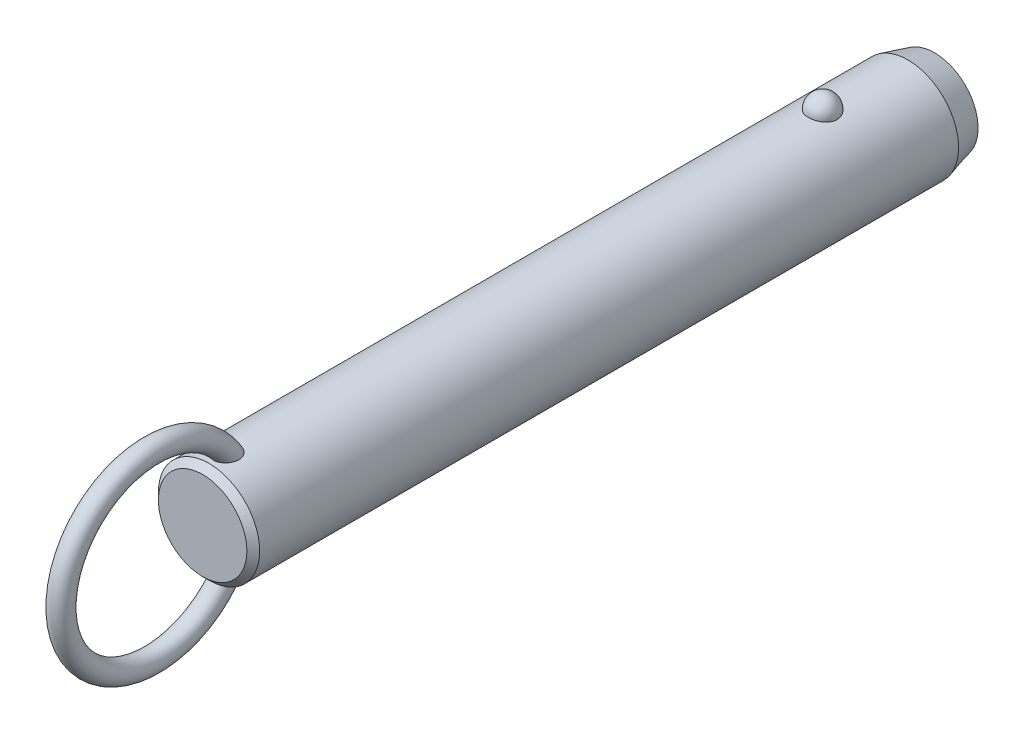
ISO-10303-21;
HEADER;
FILE_DESCRIPTION(('STEP AP214'),'2;1');
FILE_NAME('part.step','',(''),(''),'','','');
FILE_SCHEMA(('AUTOMOTIVE_DESIGN { 1 0 10303 214 1 1 1 1 }'));
ENDSEC;
DATA;
#1=APPLICATION_CONTEXT('core data for automotive mechanical design processes');
#2=APPLICATION_PROTOCOL_DEFINITION('international standard','automotive_design',2000,#1);
#3=PRODUCT_CONTEXT('',#1,'mechanical');
#4=PRODUCT('Part','Part','',(#3));
#5=PRODUCT_RELATED_PRODUCT_CATEGORY('part','',(#4));
#6=PRODUCT_DEFINITION_FORMATION('','',#4);
#7=PRODUCT_DEFINITION_CONTEXT('part definition',#1,'design');
#8=PRODUCT_DEFINITION('design','',#6,#7);
#9=PRODUCT_DEFINITION_SHAPE('','',#8);
#10=(LENGTH_UNIT() NAMED_UNIT(*) SI_UNIT(.MILLI.,.METRE.));
#11=(NAMED_UNIT(*) PLANE_ANGLE_UNIT() SI_UNIT($,.RADIAN.));
#12=(NAMED_UNIT(*) SI_UNIT($,.STERADIAN.) SOLID_ANGLE_UNIT());
#13=UNCERTAINTY_MEASURE_WITH_UNIT(LENGTH_MEASURE(1.E-05),#10,'distance_accuracy_value','');
#14=(GEOMETRIC_REPRESENTATION_CONTEXT(3) GLOBAL_UNCERTAINTY_ASSIGNED_CONTEXT((#13)) GLOBAL_UNIT_ASSIGNED_CONTEXT((#10,
#11,#12)) REPRESENTATION_CONTEXT('',''));
#15=CARTESIAN_POINT('',(0.,0.,0.));
#16=DIRECTION('',(0.,0.,1.));
#17=DIRECTION('',(1.,0.,0.));
#18=AXIS2_PLACEMENT_3D('',#15,#16,#17);
#19=CARTESIAN_POINT('',(0.,0.,104.1));
#20=DIRECTION('',(0.,0.,-1.));
#21=DIRECTION('',(-1.,0.,0.));
#22=AXIS2_PLACEMENT_3D('',#19,#20,#21);
#23=CYLINDRICAL_SURFACE('',#22,9.5);
#24=CARTESIAN_POINT('',(2.67259918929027,9.11631578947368,-2.70000000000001));
#25=CARTESIAN_POINT('',(2.6725968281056,9.11631786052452,-2.54909854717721));
#26=CARTESIAN_POINT('',(2.66030567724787,9.11994722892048,-2.39816735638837));
#27=CARTESIAN_POINT('',(2.6114347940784,9.13405924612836,-2.10058568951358));
#28=CARTESIAN_POINT('',(2.57484658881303,9.14454428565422,-1.95393672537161));
#29=CARTESIAN_POINT('',(2.47830875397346,9.17117631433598,-1.66916069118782));
#30=CARTESIAN_POINT('',(2.41836936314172,9.18732082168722,-1.53102991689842));
#31=CARTESIAN_POINT('',(2.27661331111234,9.22346780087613,-1.26705393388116));
#32=CARTESIAN_POINT('',(2.19479699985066,9.24347021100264,-1.14120852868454));
#33=CARTESIAN_POINT('',(2.01085282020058,9.28522401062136,-0.904632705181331));
#34=CARTESIAN_POINT('',(1.90862396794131,9.30698376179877,-0.793982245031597));
#35=CARTESIAN_POINT('',(1.6867437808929,9.34973971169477,-0.591607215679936));
#36=CARTESIAN_POINT('',(1.56709244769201,9.37073591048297,-0.499882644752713));
#37=CARTESIAN_POINT('',(1.31393976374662,9.40956370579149,-0.338167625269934));
#38=CARTESIAN_POINT('',(1.18048026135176,9.42740444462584,-0.268113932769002));
#39=CARTESIAN_POINT('',(0.903154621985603,9.45799906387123,-0.151390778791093));
#40=CARTESIAN_POINT('',(0.759289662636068,9.47075351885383,-0.104718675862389));
#41=CARTESIAN_POINT('',(0.468074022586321,9.48956256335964,-0.0367633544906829));
#42=CARTESIAN_POINT('',(0.320836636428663,9.49573643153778,-0.0150275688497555));
#43=CARTESIAN_POINT('',(0.0246714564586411,9.50112183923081,0.00396199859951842));
#44=CARTESIAN_POINT('',(-0.124256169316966,9.50033406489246,0.00121819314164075));
#45=CARTESIAN_POINT('',(-0.417264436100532,9.4919475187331,-0.0284441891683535));
#46=CARTESIAN_POINT('',(-0.56138413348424,9.48444885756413,-0.0550074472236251));
#47=CARTESIAN_POINT('',(-0.842986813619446,9.46357853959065,-0.131064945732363));
#48=CARTESIAN_POINT('',(-0.980469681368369,9.450206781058,-0.180559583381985));
#49=CARTESIAN_POINT('',(-1.24585005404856,9.41890822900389,-0.301476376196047));
#50=CARTESIAN_POINT('',(-1.37368611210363,9.40095498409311,-0.373026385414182));
#51=CARTESIAN_POINT('',(-1.61552738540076,9.36242964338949,-0.536025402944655));
#52=CARTESIAN_POINT('',(-1.72953116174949,9.34185727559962,-0.627476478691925));
#53=CARTESIAN_POINT('',(-1.9429225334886,9.29984568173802,-0.829844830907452));
#54=CARTESIAN_POINT('',(-2.04198021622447,9.27839736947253,-0.94110821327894));
#55=CARTESIAN_POINT('',(-2.22026460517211,9.23735994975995,-1.17883414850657));
#56=CARTESIAN_POINT('',(-2.29948985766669,9.21777097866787,-1.30529781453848));
#57=CARTESIAN_POINT('',(-2.43697287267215,9.18238994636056,-1.57158566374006));
#58=CARTESIAN_POINT('',(-2.49497068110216,9.16664569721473,-1.71155057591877));
#59=CARTESIAN_POINT('',(-2.5872073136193,9.14104303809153,-1.99961197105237));
#60=CARTESIAN_POINT('',(-2.62144683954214,9.13118445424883,-2.14770821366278));
#61=CARTESIAN_POINT('',(-2.66521466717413,9.11850622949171,-2.44715424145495));
#62=CARTESIAN_POINT('',(-2.67484831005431,9.11565658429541,-2.59848735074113));
#63=CARTESIAN_POINT('',(-2.66946735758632,9.11723375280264,-2.90067317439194));
#64=CARTESIAN_POINT('',(-2.65445345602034,9.12166036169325,-3.05152590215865));
#65=CARTESIAN_POINT('',(-2.60029711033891,9.13724422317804,-3.34766110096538));
#66=CARTESIAN_POINT('',(-2.56127978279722,9.14836656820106,-3.49296833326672));
#67=CARTESIAN_POINT('',(-2.46018844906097,9.17606676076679,-3.77477535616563));
#68=CARTESIAN_POINT('',(-2.39811349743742,9.1926448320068,-3.9112747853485));
#69=CARTESIAN_POINT('',(-2.25202303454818,9.22952198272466,-4.17244273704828));
#70=CARTESIAN_POINT('',(-2.16788714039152,9.24984129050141,-4.29704106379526));
#71=CARTESIAN_POINT('',(-1.9799408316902,9.29188255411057,-4.53013066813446));
#72=CARTESIAN_POINT('',(-1.87612963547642,9.31360456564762,-4.63862130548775));
#73=CARTESIAN_POINT('',(-1.65105429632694,9.35612959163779,-4.8369029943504));
#74=CARTESIAN_POINT('',(-1.52972405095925,9.37692871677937,-4.92661991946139));
#75=CARTESIAN_POINT('',(-1.27318250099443,9.41518970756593,-5.08429106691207));
#76=CARTESIAN_POINT('',(-1.13797219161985,9.432651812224,-5.15224684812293));
#77=CARTESIAN_POINT('',(-0.859280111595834,9.46208255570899,-5.26371827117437));
#78=CARTESIAN_POINT('',(-0.715925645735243,9.47411833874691,-5.30753421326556));
#79=CARTESIAN_POINT('',(-0.423550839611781,9.4916822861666,-5.37076321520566));
#80=CARTESIAN_POINT('',(-0.2745312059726,9.49721125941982,-5.39017930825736));
#81=CARTESIAN_POINT('',(0.0218446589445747,9.50110860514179,-5.40390587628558));
#82=CARTESIAN_POINT('',(0.16917707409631,9.49961381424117,-5.39869609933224));
#83=CARTESIAN_POINT('',(0.460808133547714,9.48993906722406,-5.36441955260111));
#84=CARTESIAN_POINT('',(0.605106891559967,9.48175936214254,-5.33535367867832));
#85=CARTESIAN_POINT('',(0.886027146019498,9.4596376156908,-5.25435587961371));
#86=CARTESIAN_POINT('',(1.02267710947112,9.44571881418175,-5.20251612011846));
#87=CARTESIAN_POINT('',(1.28523827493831,9.41358993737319,-5.07741549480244));
#88=CARTESIAN_POINT('',(1.41114877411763,9.39537958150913,-5.00415322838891));
#89=CARTESIAN_POINT('',(1.65085227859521,9.3562644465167,-4.83684599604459));
#90=CARTESIAN_POINT('',(1.76442346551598,9.33532178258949,-4.74249218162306));
#91=CARTESIAN_POINT('',(1.97425672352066,9.29321198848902,-4.53620389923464));
#92=CARTESIAN_POINT('',(2.07051582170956,9.27204482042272,-4.42426641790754));
#93=CARTESIAN_POINT('',(2.24490086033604,9.23139221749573,-4.18363183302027));
#94=CARTESIAN_POINT('',(2.32267019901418,9.21194380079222,-4.05466990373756));
#95=CARTESIAN_POINT('',(2.45584092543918,9.1773419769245,-3.78517836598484));
#96=CARTESIAN_POINT('',(2.5112497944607,9.16218713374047,-3.64465264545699));
#97=CARTESIAN_POINT('',(2.59380876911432,9.13913522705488,-3.37104301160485));
#98=CARTESIAN_POINT('',(2.62330266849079,9.13064624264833,-3.23871053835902));
#99=CARTESIAN_POINT('',(2.66269870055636,9.11923566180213,-2.97092664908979));
#100=CARTESIAN_POINT('',(2.67260130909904,9.11631393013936,-2.83547530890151));
#101=CARTESIAN_POINT('',(2.67259918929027,9.11631578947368,-2.70000000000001));
#102=B_SPLINE_CURVE_WITH_KNOTS('',3,(#24,#25,#26,#27,#28,#29,#30,#31,#32,#33,#34,#35,#36,#37,
#38,#39,#40,#41,#42,#43,#44,#45,#46,#47,#48,#49,#50,#51,#52,#53,#54,#55,#56,#57,#58,#59,#60,#61,
#62,#63,#64,#65,#66,#67,#68,#69,#70,#71,#72,#73,#74,#75,#76,#77,#78,#79,#80,#81,#82,#83,#84,#85,
#86,#87,#88,#89,#90,#91,#92,#93,#94,#95,#96,#97,#98,#99,#100,#101),.UNSPECIFIED.,.T.,.F.,(4,2,2,
2,2,2,2,2,2,2,2,2,2,2,2,2,2,2,2,2,2,2,2,2,2,2,2,2,2,2,2,2,2,2,2,2,2,2,4),(0.,0.452217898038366,
0.904593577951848,1.35677112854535,1.80894144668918,2.26340676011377,2.71787203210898,
3.17099820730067,3.62407318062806,4.0687883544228,4.51345969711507,4.95160616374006,
5.38976021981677,5.83050358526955,6.27129275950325,6.72071308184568,7.17016633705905,
7.62495278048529,8.07972578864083,8.53254856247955,8.98535859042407,9.43582813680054,
9.88631615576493,10.3393155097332,10.7923328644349,11.2471065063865,11.7018475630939,
12.150795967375,12.599688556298,13.0398725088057,13.4800399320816,13.9184421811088,
14.3568730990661,14.802202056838,15.2476074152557,15.7010097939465,16.1542603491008,
16.5602594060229,16.966248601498),.UNSPECIFIED.);
#103=CARTESIAN_POINT('',(2.67259918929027,9.11631578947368,-2.70000000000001));
#104=VERTEX_POINT('',#103);
#105=EDGE_CURVE('E41',#104,#104,#102,.T.);
#106=ORIENTED_EDGE('',*,*,#105,.T.);
#107=EDGE_LOOP('',(#106));
#108=FACE_BOUND('',#107,.T.);
#109=CARTESIAN_POINT('',(0.,0.,112.42));
#110=DIRECTION('',(0.,0.,1.));
#111=DIRECTION('',(1.,0.,0.));
#112=AXIS2_PLACEMENT_3D('',#109,#110,#111);
#113=CIRCLE('',#112,9.5);
#114=CARTESIAN_POINT('',(9.5,0.,112.42));
#115=VERTEX_POINT('',#114);
#116=EDGE_CURVE('E10',#115,#115,#113,.F.);
#117=ORIENTED_EDGE('',*,*,#116,.T.);
#118=EDGE_LOOP('',(#117));
#119=FACE_BOUND('',#118,.T.);
#120=CARTESIAN_POINT('',(-0.697062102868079,-9.47439269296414,106.767808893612));
#121=CARTESIAN_POINT('',(-0.799579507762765,-9.46685146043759,106.807482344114));
#122=CARTESIAN_POINT('',(-0.898575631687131,-9.45788043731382,106.8559309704));
#123=CARTESIAN_POINT('',(-1.08670047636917,-9.43811593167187,106.968868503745));
#124=CARTESIAN_POINT('',(-1.17583204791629,-9.42732297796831,107.033352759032));
#125=CARTESIAN_POINT('',(-1.34179806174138,-9.40513672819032,107.176209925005));
#126=CARTESIAN_POINT('',(-1.41865133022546,-9.39374438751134,107.254561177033));
#127=CARTESIAN_POINT('',(-1.5586004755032,-9.37154196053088,107.422752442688));
#128=CARTESIAN_POINT('',(-1.62169476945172,-9.3607319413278,107.51259377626));
#129=CARTESIAN_POINT('',(-1.73527695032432,-9.34035749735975,107.704500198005));
#130=CARTESIAN_POINT('',(-1.7852226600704,-9.33085270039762,107.806891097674));
#131=CARTESIAN_POINT('',(-1.86924997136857,-9.3143834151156,108.018148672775));
#132=CARTESIAN_POINT('',(-1.90332570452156,-9.30741986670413,108.127017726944));
#133=CARTESIAN_POINT('',(-1.95893603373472,-9.29588482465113,108.360473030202));
#134=CARTESIAN_POINT('',(-1.97872420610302,-9.29165182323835,108.485489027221));
#135=CARTESIAN_POINT('',(-2.00062129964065,-9.28695978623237,108.737080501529));
#136=CARTESIAN_POINT('',(-2.00272284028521,-9.28650232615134,108.863656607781));
#137=CARTESIAN_POINT('',(-1.98958876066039,-9.28932750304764,109.136815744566));
#138=CARTESIAN_POINT('',(-1.97143366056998,-9.2932400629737,109.283251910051));
#139=CARTESIAN_POINT('',(-1.91479925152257,-9.30507151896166,109.572062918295));
#140=CARTESIAN_POINT('',(-1.87629122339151,-9.31299607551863,109.714431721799));
#141=CARTESIAN_POINT('',(-1.77225683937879,-9.33340232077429,110.015172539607));
#142=CARTESIAN_POINT('',(-1.70334898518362,-9.34641636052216,110.172369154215));
#143=CARTESIAN_POINT('',(-1.58111062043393,-9.36759153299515,110.397517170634));
#144=CARTESIAN_POINT('',(-1.53721459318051,-9.37492619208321,110.470796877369));
#145=CARTESIAN_POINT('',(-1.44302631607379,-9.38988566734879,110.61307405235));
#146=CARTESIAN_POINT('',(-1.39273721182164,-9.39751033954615,110.682073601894));
#147=CARTESIAN_POINT('',(-1.26775962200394,-9.41530678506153,110.836983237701));
#148=CARTESIAN_POINT('',(-1.19052326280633,-9.42548108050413,110.920871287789));
#149=CARTESIAN_POINT('',(-1.02420241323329,-9.44499825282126,111.076008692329));
#150=CARTESIAN_POINT('',(-0.935139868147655,-9.45434261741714,111.147280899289));
#151=CARTESIAN_POINT('',(-0.766610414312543,-9.46930670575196,111.258695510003));
#152=CARTESIAN_POINT('',(-0.689439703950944,-9.47529223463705,111.302235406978));
#153=CARTESIAN_POINT('',(-0.528942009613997,-9.48560294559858,111.37631336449));
#154=CARTESIAN_POINT('',(-0.445620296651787,-9.48992953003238,111.406862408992));
#155=CARTESIAN_POINT('',(-0.273901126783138,-9.49644161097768,111.452579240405));
#156=CARTESIAN_POINT('',(-0.185465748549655,-9.49860811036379,111.46761059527));
#157=CARTESIAN_POINT('',(-0.00734541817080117,-9.5004135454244,111.480149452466));
#158=CARTESIAN_POINT('',(0.0823387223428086,-9.50005405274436,111.477667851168));
#159=CARTESIAN_POINT('',(0.247679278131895,-9.49708301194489,111.456995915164));
#160=CARTESIAN_POINT('',(0.323620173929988,-9.49477609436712,111.440930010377));
#161=CARTESIAN_POINT('',(0.471981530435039,-9.48855917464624,111.397172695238));
#162=CARTESIAN_POINT('',(0.544400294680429,-9.48464840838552,111.369475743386));
#163=CARTESIAN_POINT('',(0.70894789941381,-9.47398336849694,111.29280266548));
#164=CARTESIAN_POINT('',(0.799149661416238,-9.46671310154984,111.239774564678));
#165=CARTESIAN_POINT('',(0.969783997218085,-9.45076225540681,111.119973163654));
#166=CARTESIAN_POINT('',(1.05019415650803,-9.44207854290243,111.053169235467));
#167=CARTESIAN_POINT('',(1.23092343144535,-9.42051459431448,110.880759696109));
#168=CARTESIAN_POINT('',(1.3265249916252,-9.40733378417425,110.77026193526));
#169=CARTESIAN_POINT('',(1.49893121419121,-9.38140745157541,110.535561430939));
#170=CARTESIAN_POINT('',(1.57571616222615,-9.36866239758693,110.411344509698));
#171=CARTESIAN_POINT('',(1.71285426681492,-9.34457644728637,110.149389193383));
#172=CARTESIAN_POINT('',(1.77266365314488,-9.33328726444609,110.01136233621));
#173=CARTESIAN_POINT('',(1.87239208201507,-9.31379209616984,109.728051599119));
#174=CARTESIAN_POINT('',(1.9123015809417,-9.3055875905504,109.582764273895));
#175=CARTESIAN_POINT('',(1.97604189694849,-9.29228394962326,109.262028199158));
#176=CARTESIAN_POINT('',(1.99587438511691,-9.28797202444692,109.085724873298));
#177=CARTESIAN_POINT('',(2.0029570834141,-9.28645519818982,108.732414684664));
#178=CARTESIAN_POINT('',(1.99025930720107,-9.28923895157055,108.555409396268));
#179=CARTESIAN_POINT('',(1.93735479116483,-9.30038134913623,108.256338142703));
#180=CARTESIAN_POINT('',(1.90576827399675,-9.30697680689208,108.132667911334));
#181=CARTESIAN_POINT('',(1.82287484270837,-9.32356855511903,107.892329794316));
#182=CARTESIAN_POINT('',(1.77158213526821,-9.33356239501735,107.775656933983));
#183=CARTESIAN_POINT('',(1.64885744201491,-9.35602275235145,107.552706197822));
#184=CARTESIAN_POINT('',(1.57730995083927,-9.36850332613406,107.446492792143));
#185=CARTESIAN_POINT('',(1.4154326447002,-9.39431873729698,107.249553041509));
#186=CARTESIAN_POINT('',(1.32510883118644,-9.40765330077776,107.158821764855));
#187=CARTESIAN_POINT('',(1.13846223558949,-9.43195720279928,107.005033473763));
#188=CARTESIAN_POINT('',(1.04369890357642,-9.44302894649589,106.940094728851));
#189=CARTESIAN_POINT('',(0.843965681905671,-9.46296805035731,106.828038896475));
#190=CARTESIAN_POINT('',(0.739000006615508,-9.47183631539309,106.780914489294));
#191=CARTESIAN_POINT('',(0.528175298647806,-9.48586140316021,106.708117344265));
#192=CARTESIAN_POINT('',(0.422686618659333,-9.49119633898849,106.68140249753));
#193=CARTESIAN_POINT('',(0.208590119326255,-9.49831365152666,106.646013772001));
#194=CARTESIAN_POINT('',(0.0999817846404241,-9.500095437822,106.637342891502));
#195=CARTESIAN_POINT('',(-0.126104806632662,-9.49988861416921,106.638350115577));
#196=CARTESIAN_POINT('',(-0.24357872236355,-9.49757821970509,106.649594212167));
#197=CARTESIAN_POINT('',(-0.474390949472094,-9.48885165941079,106.693167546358));
#198=CARTESIAN_POINT('',(-0.587729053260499,-9.48243528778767,106.725497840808));
#199=CARTESIAN_POINT('',(-0.697062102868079,-9.47439269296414,106.767808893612));
#200=B_SPLINE_CURVE_WITH_KNOTS('',3,(#120,#121,#122,#123,#124,#125,#126,#127,#128,#129,#130,
#131,#132,#133,#134,#135,#136,#137,#138,#139,#140,#141,#142,#143,#144,#145,#146,#147,#148,#149,
#150,#151,#152,#153,#154,#155,#156,#157,#158,#159,#160,#161,#162,#163,#164,#165,#166,#167,#168,
#169,#170,#171,#172,#173,#174,#175,#176,#177,#178,#179,#180,#181,#182,#183,#184,#185,#186,#187,
#188,#189,#190,#191,#192,#193,#194,#195,#196,#197,#198,#199),.UNSPECIFIED.,.T.,.F.,(4,2,2,2,2,2,
2,2,2,2,2,2,2,2,2,2,2,2,2,2,2,2,2,2,2,2,2,2,2,2,2,2,2,2,2,2,2,2,2,4),(0.,0.330119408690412,
0.660143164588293,0.989655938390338,1.31920659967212,1.66074728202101,2.00241415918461,
2.38088696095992,2.7595176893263,3.20065679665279,3.6424200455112,4.15620996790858,
4.41314162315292,4.66994734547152,5.01228664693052,5.35399933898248,5.61943037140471,
5.88463652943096,6.15215502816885,6.41950709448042,6.65144391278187,6.88349136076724,
7.19641200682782,7.51003602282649,7.94779711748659,8.38601491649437,8.83699707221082,
9.28819530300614,9.81778662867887,10.3465317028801,10.7284172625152,11.110028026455,
11.4938603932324,11.8775702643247,12.2220189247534,12.5663259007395,12.8915939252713,
13.2169159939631,13.5689650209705,13.9210316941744),.UNSPECIFIED.);
#201=CARTESIAN_POINT('',(-0.697062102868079,-9.47439269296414,106.767808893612));
#202=VERTEX_POINT('',#201);
#203=EDGE_CURVE('E60',#202,#202,#200,.T.);
#204=ORIENTED_EDGE('',*,*,#203,.T.);
#205=EDGE_LOOP('',(#204));
#206=FACE_BOUND('',#205,.T.);
#207=CARTESIAN_POINT('',(-0.697062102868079,9.47439269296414,106.767808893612));
#208=CARTESIAN_POINT('',(-0.597792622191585,9.48169483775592,106.72939564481));
#209=CARTESIAN_POINT('',(-0.495106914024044,9.48766580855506,106.699168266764));
#210=CARTESIAN_POINT('',(-0.285876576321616,9.49627648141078,106.656032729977));
#211=CARTESIAN_POINT('',(-0.179324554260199,9.49890941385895,106.643159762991));
#212=CARTESIAN_POINT('',(0.0344157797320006,9.50053798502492,106.635166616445));
#213=CARTESIAN_POINT('',(0.141603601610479,9.49953613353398,106.640034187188));
#214=CARTESIAN_POINT('',(0.353563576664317,9.49401038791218,106.667365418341));
#215=CARTESIAN_POINT('',(0.458336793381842,9.48948807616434,106.68982117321));
#216=CARTESIAN_POINT('',(0.662493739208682,9.4774236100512,106.751671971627));
#217=CARTESIAN_POINT('',(0.761881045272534,9.46988348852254,106.791055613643));
#218=CARTESIAN_POINT('',(0.952608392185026,9.45260382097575,106.885634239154));
#219=CARTESIAN_POINT('',(1.04394806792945,9.44286417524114,106.940829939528));
#220=CARTESIAN_POINT('',(1.21712767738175,9.42211760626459,107.066066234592));
#221=CARTESIAN_POINT('',(1.29885671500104,9.41109835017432,107.136257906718));
#222=CARTESIAN_POINT('',(1.44978975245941,9.38903310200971,107.288980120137));
#223=CARTESIAN_POINT('',(1.51899278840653,9.37798710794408,107.371511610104));
#224=CARTESIAN_POINT('',(1.64602857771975,9.35654375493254,107.549776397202));
#225=CARTESIAN_POINT('',(1.70333052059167,9.34618688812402,107.645891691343));
#226=CARTESIAN_POINT('',(1.80259341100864,9.32755128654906,107.845897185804));
#227=CARTESIAN_POINT('',(1.84454942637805,9.31927322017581,107.949789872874));
#228=CARTESIAN_POINT('',(1.91637039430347,9.30478365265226,108.172213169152));
#229=CARTESIAN_POINT('',(1.944805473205,9.29882552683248,108.291219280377));
#230=CARTESIAN_POINT('',(1.98449865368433,9.29043398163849,108.532143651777));
#231=CARTESIAN_POINT('',(1.99574908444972,9.28800213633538,108.654063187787));
#232=CARTESIAN_POINT('',(2.00275141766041,9.28649645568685,108.916932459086));
#233=CARTESIAN_POINT('',(1.99588238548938,9.28799035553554,109.057952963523));
#234=CARTESIAN_POINT('',(1.96270559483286,9.29505517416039,109.337621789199));
#235=CARTESIAN_POINT('',(1.93637872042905,9.30063010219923,109.476267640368));
#236=CARTESIAN_POINT('',(1.85949176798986,9.31633564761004,109.772561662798));
#237=CARTESIAN_POINT('',(1.80549792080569,9.3270926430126,109.929290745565));
#238=CARTESIAN_POINT('',(1.67376869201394,9.3516306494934,110.232284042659));
#239=CARTESIAN_POINT('',(1.59603181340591,9.36541185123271,110.378547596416));
#240=CARTESIAN_POINT('',(1.4360277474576,9.39110706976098,110.625813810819));
#241=CARTESIAN_POINT('',(1.35831795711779,9.40278656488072,110.729791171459));
#242=CARTESIAN_POINT('',(1.18774483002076,9.42585025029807,110.924534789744));
#243=CARTESIAN_POINT('',(1.09490932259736,9.43723493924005,111.015324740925));
#244=CARTESIAN_POINT('',(0.921110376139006,9.45552616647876,111.15620334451));
#245=CARTESIAN_POINT('',(0.843738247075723,9.46281058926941,111.210656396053));
#246=CARTESIAN_POINT('',(0.681245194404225,9.47589120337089,111.306711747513));
#247=CARTESIAN_POINT('',(0.596135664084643,9.48168953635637,111.348332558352));
#248=CARTESIAN_POINT('',(0.433779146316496,9.49038144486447,111.410089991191));
#249=CARTESIAN_POINT('',(0.357459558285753,9.49359170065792,111.43260136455));
#250=CARTESIAN_POINT('',(0.202074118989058,9.49816761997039,111.464574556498));
#251=CARTESIAN_POINT('',(0.123010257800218,9.49953459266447,111.474045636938));
#252=CARTESIAN_POINT('',(-0.0357372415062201,9.50026497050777,111.479114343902));
#253=CARTESIAN_POINT('',(-0.115421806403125,9.49962433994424,111.474684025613));
#254=CARTESIAN_POINT('',(-0.272823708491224,9.49640854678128,111.452296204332));
#255=CARTESIAN_POINT('',(-0.350540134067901,9.4938325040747,111.434332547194));
#256=CARTESIAN_POINT('',(-0.500580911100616,9.4870946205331,111.386802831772));
#257=CARTESIAN_POINT('',(-0.57297929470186,9.48296359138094,111.357461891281));
#258=CARTESIAN_POINT('',(-0.712864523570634,9.47347609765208,111.289008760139));
#259=CARTESIAN_POINT('',(-0.780349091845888,9.46811906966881,111.249892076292));
#260=CARTESIAN_POINT('',(-0.946309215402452,9.45329720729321,111.139432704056));
#261=CARTESIAN_POINT('',(-1.04090230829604,9.44321512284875,111.062329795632));
#262=CARTESIAN_POINT('',(-1.21661929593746,9.42219227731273,110.89409718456));
#263=CARTESIAN_POINT('',(-1.29770519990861,9.41124921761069,110.802929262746));
#264=CARTESIAN_POINT('',(-1.47319646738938,9.38563439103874,110.576162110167));
#265=CARTESIAN_POINT('',(-1.56208878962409,9.37102009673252,110.436289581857));
#266=CARTESIAN_POINT('',(-1.71623987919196,9.34401559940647,110.143950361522));
#267=CARTESIAN_POINT('',(-1.78147866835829,9.33162728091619,109.991473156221));
#268=CARTESIAN_POINT('',(-1.88853837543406,9.31055541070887,109.675647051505));
#269=CARTESIAN_POINT('',(-1.92998995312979,9.30193076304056,109.512168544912));
#270=CARTESIAN_POINT('',(-1.98590726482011,9.29015757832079,109.180526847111));
#271=CARTESIAN_POINT('',(-2.0004070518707,9.2870021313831,109.012369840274));
#272=CARTESIAN_POINT('',(-1.99964701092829,9.28716218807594,108.705080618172));
#273=CARTESIAN_POINT('',(-1.98908145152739,9.28945704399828,108.565936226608));
#274=CARTESIAN_POINT('',(-1.94566294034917,9.29865169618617,108.291153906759));
#275=CARTESIAN_POINT('',(-1.91282062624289,9.30554929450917,108.155514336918));
#276=CARTESIAN_POINT('',(-1.84582133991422,9.31898248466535,107.957802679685));
#277=CARTESIAN_POINT('',(-1.82038084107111,9.32400364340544,107.892583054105));
#278=CARTESIAN_POINT('',(-1.7635051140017,9.33492884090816,107.764903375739));
#279=CARTESIAN_POINT('',(-1.73207305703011,9.34083241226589,107.702441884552));
#280=CARTESIAN_POINT('',(-1.6632424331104,9.353333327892,107.58094078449));
#281=CARTESIAN_POINT('',(-1.62584239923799,9.35993084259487,107.521902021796));
#282=CARTESIAN_POINT('',(-1.54527678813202,9.37356864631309,107.407987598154));
#283=CARTESIAN_POINT('',(-1.50211241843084,9.38060884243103,107.353111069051));
#284=CARTESIAN_POINT('',(-1.37681147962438,9.40004442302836,107.209961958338));
#285=CARTESIAN_POINT('',(-1.28916358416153,9.41261047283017,107.126429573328));
#286=CARTESIAN_POINT('',(-1.09996826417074,9.43658180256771,106.977236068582));
#287=CARTESIAN_POINT('',(-0.998461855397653,9.44799034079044,106.911523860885));
#288=CARTESIAN_POINT('',(-0.860188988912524,9.46103017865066,106.8394367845));
#289=CARTESIAN_POINT('',(-0.828141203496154,9.46389141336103,106.823851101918));
#290=CARTESIAN_POINT('',(-0.763210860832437,9.46934915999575,106.794473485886));
#291=CARTESIAN_POINT('',(-0.730328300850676,9.47194567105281,106.780681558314));
#292=CARTESIAN_POINT('',(-0.697062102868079,9.47439269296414,106.767808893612));
#293=B_SPLINE_CURVE_WITH_KNOTS('',3,(#207,#208,#209,#210,#211,#212,#213,#214,#215,#216,#217,
#218,#219,#220,#221,#222,#223,#224,#225,#226,#227,#228,#229,#230,#231,#232,#233,#234,#235,#236,
#237,#238,#239,#240,#241,#242,#243,#244,#245,#246,#247,#248,#249,#250,#251,#252,#253,#254,#255,
#256,#257,#258,#259,#260,#261,#262,#263,#264,#265,#266,#267,#268,#269,#270,#271,#272,#273,#274,
#275,#276,#277,#278,#279,#280,#281,#282,#283,#284,#285,#286,#287,#288,#289,#290,#291,#292),
.UNSPECIFIED.,.T.,.F.,(4,2,2,2,2,2,2,2,2,2,2,2,2,2,2,2,2,2,2,2,2,2,2,2,2,2,2,2,2,2,2,2,2,2,2,2,
2,2,2,2,2,2,4),(0.,0.319942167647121,0.640532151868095,0.960900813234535,1.28112555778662,
1.60113495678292,1.92115886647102,2.24457323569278,2.56801248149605,2.90371927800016,
3.23953387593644,3.60560313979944,3.97183576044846,4.39383693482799,4.81625324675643,
5.31257045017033,5.80891895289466,6.19868344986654,6.58773876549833,6.87145417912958,
7.15475838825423,7.3926375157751,7.63034760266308,7.86853584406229,8.10683246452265,
8.3406366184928,8.57454843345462,8.93983939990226,9.30614105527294,9.8026666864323,
10.2996107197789,10.8040753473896,11.3079021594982,11.7249776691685,12.1418541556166,
12.3521485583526,12.562331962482,12.7725671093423,12.9827582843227,13.3458276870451,
13.7078449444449,13.8150604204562,13.9222762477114),.UNSPECIFIED.);
#294=CARTESIAN_POINT('',(-0.697062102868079,9.47439269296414,106.767808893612));
#295=VERTEX_POINT('',#294);
#296=EDGE_CURVE('E68',#295,#295,#293,.T.);
#297=ORIENTED_EDGE('',*,*,#296,.T.);
#298=EDGE_LOOP('',(#297));
#299=FACE_BOUND('',#298,.T.);
#300=CARTESIAN_POINT('',(0.,0.,-18.6999999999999));
#301=DIRECTION('',(0.,0.,-1.));
#302=DIRECTION('',(-1.,0.,0.));
#303=AXIS2_PLACEMENT_3D('',#300,#301,#302);
#304=CIRCLE('',#303,9.5);
#305=CARTESIAN_POINT('',(-9.5,0.,-18.6999999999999));
#306=VERTEX_POINT('',#305);
#307=EDGE_CURVE('E57',#306,#306,#304,.F.);
#308=ORIENTED_EDGE('',*,*,#307,.T.);
#309=EDGE_LOOP('',(#308));
#310=FACE_BOUND('',#309,.T.);
#311=ADVANCED_FACE('F37',(#108,#119,#206,#299,#310),#23,.T.);
#312=CARTESIAN_POINT('',(0.,0.,-23.7));
#313=DIRECTION('',(0.,0.,-1.));
#314=DIRECTION('',(-1.,0.,0.));
#315=AXIS2_PLACEMENT_3D('',#312,#313,#314);
#316=PLANE('',#315);
#317=CARTESIAN_POINT('',(0.,0.,-23.7));
#318=DIRECTION('',(0.,0.,-1.));
#319=DIRECTION('',(-1.,0.,0.));
#320=AXIS2_PLACEMENT_3D('',#317,#318,#319);
#321=CIRCLE('',#320,8.16025403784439);
#322=CARTESIAN_POINT('',(-8.16025403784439,0.,-23.7));
#323=VERTEX_POINT('',#322);
#324=EDGE_CURVE('E67',#323,#323,#321,.T.);
#325=ORIENTED_EDGE('',*,*,#324,.T.);
#326=EDGE_LOOP('',(#325));
#327=FACE_BOUND('',#326,.T.);
#328=ADVANCED_FACE('F86',(#327),#316,.T.);
#329=CARTESIAN_POINT('',(0.,0.,-23.7));
#330=DIRECTION('',(0.,0.,1.));
#331=DIRECTION('',(1.,0.,0.));
#332=AXIS2_PLACEMENT_3D('',#329,#330,#331);
#333=CONICAL_SURFACE('',#332,8.16025403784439,0.261799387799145);
#334=ORIENTED_EDGE('',*,*,#307,.F.);
#335=EDGE_LOOP('',(#334));
#336=FACE_BOUND('',#335,.T.);
#337=ORIENTED_EDGE('',*,*,#324,.F.);
#338=EDGE_LOOP('',(#337));
#339=FACE_BOUND('',#338,.T.);
#340=ADVANCED_FACE('F84',(#336,#339),#333,.T.);
#341=CARTESIAN_POINT('',(0.,0.,113.62));
#342=DIRECTION('',(0.,0.,1.));
#343=DIRECTION('',(1.,0.,0.));
#344=AXIS2_PLACEMENT_3D('',#341,#342,#343);
#345=PLANE('',#344);
#346=CARTESIAN_POINT('',(0.,0.,113.62));
#347=DIRECTION('',(0.,0.,1.));
#348=DIRECTION('',(1.,0.,0.));
#349=AXIS2_PLACEMENT_3D('',#346,#347,#348);
#350=CIRCLE('',#349,8.30000000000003);
#351=CARTESIAN_POINT('',(8.30000000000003,0.,113.62));
#352=VERTEX_POINT('',#351);
#353=EDGE_CURVE('E50',#352,#352,#350,.T.);
#354=ORIENTED_EDGE('',*,*,#353,.T.);
#355=EDGE_LOOP('',(#354));
#356=FACE_BOUND('',#355,.T.);
#357=ADVANCED_FACE('F78',(#356),#345,.T.);
#358=CARTESIAN_POINT('',(0.,0.,123.15));
#359=DIRECTION('',(1.,0.,0.));
#360=DIRECTION('',(0.,0.,-1.));
#361=AXIS2_PLACEMENT_3D('',#358,#359,#360);
#362=TOROIDAL_SURFACE('',#361,17.05,2.);
#363=ORIENTED_EDGE('',*,*,#296,.F.);
#364=EDGE_LOOP('',(#363));
#365=FACE_BOUND('',#364,.T.);
#366=ORIENTED_EDGE('',*,*,#203,.F.);
#367=EDGE_LOOP('',(#366));
#368=FACE_BOUND('',#367,.T.);
#369=ADVANCED_FACE('F74',(#365,#368),#362,.T.);
#370=CARTESIAN_POINT('',(0.,0.,113.62));
#371=DIRECTION('',(0.,0.,-1.));
#372=DIRECTION('',(-1.,0.,0.));
#373=AXIS2_PLACEMENT_3D('',#370,#371,#372);
#374=CONICAL_SURFACE('',#373,8.30000000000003,0.785398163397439);
#375=ORIENTED_EDGE('',*,*,#116,.F.);
#376=EDGE_LOOP('',(#375));
#377=FACE_BOUND('',#376,.T.);
#378=ORIENTED_EDGE('',*,*,#353,.F.);
#379=EDGE_LOOP('',(#378));
#380=FACE_BOUND('',#379,.T.);
#381=ADVANCED_FACE('F39',(#377,#380),#374,.T.);
#382=CARTESIAN_POINT('',(0.,9.5,-2.70000000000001));
#383=DIRECTION('',(0.,1.,0.));
#384=DIRECTION('',(0.,0.,-1.));
#385=AXIS2_PLACEMENT_3D('',#382,#383,#384);
#386=SPHERICAL_SURFACE('',#385,2.7);
#387=ORIENTED_EDGE('',*,*,#105,.F.);
#388=EDGE_LOOP('',(#387));
#389=FACE_BOUND('',#388,.T.);
#390=ADVANCED_FACE('F80',(#389),#386,.T.);
#391=CLOSED_SHELL('',(#311,#328,#340,#357,#369,#381,#390));
#392=MANIFOLD_SOLID_BREP('B2',#391);
#393=ADVANCED_BREP_SHAPE_REPRESENTATION('',(#18,#392),#14);
#394=SHAPE_DEFINITION_REPRESENTATION(#9,#393);
ENDSEC;
END-ISO-10303-21;
